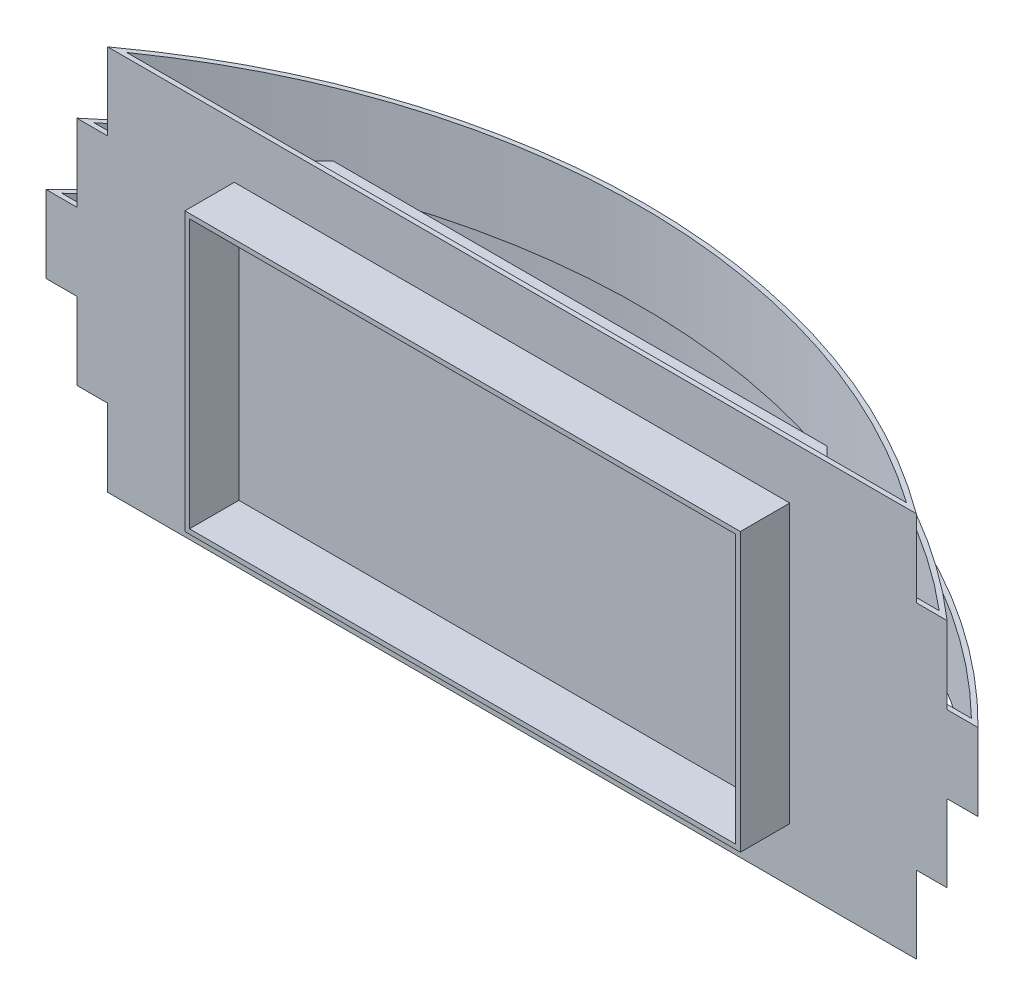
ISO-10303-21;
HEADER;
FILE_DESCRIPTION(('STEP AP214'),'2;1');
FILE_NAME('part.step','',(''),(''),'','','');
FILE_SCHEMA(('AUTOMOTIVE_DESIGN { 1 0 10303 214 1 1 1 1 }'));
ENDSEC;
DATA;
#1=APPLICATION_CONTEXT('core data for automotive mechanical design processes');
#2=APPLICATION_PROTOCOL_DEFINITION('international standard','automotive_design',2000,#1);
#3=PRODUCT_CONTEXT('',#1,'mechanical');
#4=PRODUCT('Part','Part','',(#3));
#5=PRODUCT_RELATED_PRODUCT_CATEGORY('part','',(#4));
#6=PRODUCT_DEFINITION_FORMATION('','',#4);
#7=PRODUCT_DEFINITION_CONTEXT('part definition',#1,'design');
#8=PRODUCT_DEFINITION('design','',#6,#7);
#9=PRODUCT_DEFINITION_SHAPE('','',#8);
#10=(LENGTH_UNIT() NAMED_UNIT(*) SI_UNIT(.MILLI.,.METRE.));
#11=(NAMED_UNIT(*) PLANE_ANGLE_UNIT() SI_UNIT($,.RADIAN.));
#12=(NAMED_UNIT(*) SI_UNIT($,.STERADIAN.) SOLID_ANGLE_UNIT());
#13=UNCERTAINTY_MEASURE_WITH_UNIT(LENGTH_MEASURE(1.E-05),#10,'distance_accuracy_value','');
#14=(GEOMETRIC_REPRESENTATION_CONTEXT(3) GLOBAL_UNCERTAINTY_ASSIGNED_CONTEXT((#13)) GLOBAL_UNIT_ASSIGNED_CONTEXT((#10,
#11,#12)) REPRESENTATION_CONTEXT('',''));
#15=CARTESIAN_POINT('',(0.,0.,0.));
#16=DIRECTION('',(0.,0.,1.));
#17=DIRECTION('',(1.,0.,0.));
#18=AXIS2_PLACEMENT_3D('',#15,#16,#17);
#19=CARTESIAN_POINT('',(-151.,-12.5,0.));
#20=DIRECTION('',(0.,0.,1.));
#21=DIRECTION('',(1.,0.,0.));
#22=AXIS2_PLACEMENT_3D('',#19,#20,#21);
#23=PLANE('',#22);
#24=DIRECTION('',(1.,0.,0.));
#25=VECTOR('',#24,1.);
#26=CARTESIAN_POINT('',(-141.,-37.5,0.));
#27=LINE('',#26,#25);
#28=CARTESIAN_POINT('',(-141.,-37.5,0.));
#29=VERTEX_POINT('',#28);
#30=CARTESIAN_POINT('',(-131.,-37.5,0.));
#31=VERTEX_POINT('',#30);
#32=EDGE_CURVE('E534',#29,#31,#27,.T.);
#33=ORIENTED_EDGE('',*,*,#32,.T.);
#34=DIRECTION('',(0.,1.,0.));
#35=VECTOR('',#34,1.);
#36=CARTESIAN_POINT('',(-131.,-62.5,0.));
#37=LINE('',#36,#35);
#38=CARTESIAN_POINT('',(-131.,-62.5,0.));
#39=VERTEX_POINT('',#38);
#40=EDGE_CURVE('E498',#39,#31,#37,.T.);
#41=ORIENTED_EDGE('',*,*,#40,.F.);
#42=DIRECTION('',(1.,0.,0.));
#43=VECTOR('',#42,1.);
#44=CARTESIAN_POINT('',(-131.,-62.5,0.));
#45=LINE('',#44,#43);
#46=CARTESIAN_POINT('',(131.,-62.5,0.));
#47=VERTEX_POINT('',#46);
#48=EDGE_CURVE('E494',#39,#47,#45,.T.);
#49=ORIENTED_EDGE('',*,*,#48,.T.);
#50=DIRECTION('',(0.,1.,0.));
#51=VECTOR('',#50,1.);
#52=CARTESIAN_POINT('',(131.,-62.5,0.));
#53=LINE('',#52,#51);
#54=CARTESIAN_POINT('',(131.,-37.5,0.));
#55=VERTEX_POINT('',#54);
#56=EDGE_CURVE('E505',#47,#55,#53,.T.);
#57=ORIENTED_EDGE('',*,*,#56,.T.);
#58=CARTESIAN_POINT('',(141.,-37.5,0.));
#59=VERTEX_POINT('',#58);
#60=EDGE_CURVE('E533',#55,#59,#27,.T.);
#61=ORIENTED_EDGE('',*,*,#60,.T.);
#62=DIRECTION('',(0.,1.,0.));
#63=VECTOR('',#62,1.);
#64=CARTESIAN_POINT('',(141.,-37.5,0.));
#65=LINE('',#64,#63);
#66=CARTESIAN_POINT('',(141.,-12.5,0.));
#67=VERTEX_POINT('',#66);
#68=EDGE_CURVE('E545',#59,#67,#65,.T.);
#69=ORIENTED_EDGE('',*,*,#68,.T.);
#70=DIRECTION('',(1.,0.,0.));
#71=VECTOR('',#70,1.);
#72=CARTESIAN_POINT('',(-151.,-12.5,0.));
#73=LINE('',#72,#71);
#74=CARTESIAN_POINT('',(151.,-12.5,0.));
#75=VERTEX_POINT('',#74);
#76=EDGE_CURVE('E680',#67,#75,#73,.T.);
#77=ORIENTED_EDGE('',*,*,#76,.T.);
#78=DIRECTION('',(0.,1.,0.));
#79=VECTOR('',#78,1.);
#80=CARTESIAN_POINT('',(151.,-12.5,0.));
#81=LINE('',#80,#79);
#82=CARTESIAN_POINT('',(151.,12.5,0.));
#83=VERTEX_POINT('',#82);
#84=EDGE_CURVE('E686',#75,#83,#81,.T.);
#85=ORIENTED_EDGE('',*,*,#84,.T.);
#86=DIRECTION('',(1.,0.,0.));
#87=VECTOR('',#86,1.);
#88=CARTESIAN_POINT('',(-151.,12.5,0.));
#89=LINE('',#88,#87);
#90=CARTESIAN_POINT('',(141.,12.5,0.));
#91=VERTEX_POINT('',#90);
#92=EDGE_CURVE('E655',#91,#83,#89,.T.);
#93=ORIENTED_EDGE('',*,*,#92,.F.);
#94=DIRECTION('',(0.,-1.,0.));
#95=VECTOR('',#94,1.);
#96=CARTESIAN_POINT('',(141.,37.5,0.));
#97=LINE('',#96,#95);
#98=CARTESIAN_POINT('',(141.,37.5,0.));
#99=VERTEX_POINT('',#98);
#100=EDGE_CURVE('E626',#99,#91,#97,.T.);
#101=ORIENTED_EDGE('',*,*,#100,.F.);
#102=DIRECTION('',(1.,0.,0.));
#103=VECTOR('',#102,1.);
#104=CARTESIAN_POINT('',(-141.,37.5,0.));
#105=LINE('',#104,#103);
#106=CARTESIAN_POINT('',(131.,37.5,0.));
#107=VERTEX_POINT('',#106);
#108=EDGE_CURVE('E621',#107,#99,#105,.T.);
#109=ORIENTED_EDGE('',*,*,#108,.F.);
#110=DIRECTION('',(0.,-1.,0.));
#111=VECTOR('',#110,1.);
#112=CARTESIAN_POINT('',(131.,62.5,0.));
#113=LINE('',#112,#111);
#114=CARTESIAN_POINT('',(131.,62.5,0.));
#115=VERTEX_POINT('',#114);
#116=EDGE_CURVE('E581',#115,#107,#113,.T.);
#117=ORIENTED_EDGE('',*,*,#116,.F.);
#118=DIRECTION('',(1.,0.,0.));
#119=VECTOR('',#118,1.);
#120=CARTESIAN_POINT('',(-131.,62.5,0.));
#121=LINE('',#120,#119);
#122=CARTESIAN_POINT('',(-131.,62.5,0.));
#123=VERTEX_POINT('',#122);
#124=EDGE_CURVE('E578',#123,#115,#121,.T.);
#125=ORIENTED_EDGE('',*,*,#124,.F.);
#126=DIRECTION('',(0.,-1.,0.));
#127=VECTOR('',#126,1.);
#128=CARTESIAN_POINT('',(-131.,62.5,0.));
#129=LINE('',#128,#127);
#130=CARTESIAN_POINT('',(-131.,37.5,0.));
#131=VERTEX_POINT('',#130);
#132=EDGE_CURVE('E587',#123,#131,#129,.T.);
#133=ORIENTED_EDGE('',*,*,#132,.T.);
#134=CARTESIAN_POINT('',(-141.,37.5,0.));
#135=VERTEX_POINT('',#134);
#136=EDGE_CURVE('E622',#135,#131,#105,.T.);
#137=ORIENTED_EDGE('',*,*,#136,.F.);
#138=DIRECTION('',(0.,-1.,0.));
#139=VECTOR('',#138,1.);
#140=CARTESIAN_POINT('',(-141.,37.5,0.));
#141=LINE('',#140,#139);
#142=CARTESIAN_POINT('',(-141.,12.5,0.));
#143=VERTEX_POINT('',#142);
#144=EDGE_CURVE('E632',#135,#143,#141,.T.);
#145=ORIENTED_EDGE('',*,*,#144,.T.);
#146=CARTESIAN_POINT('',(-151.,12.5,0.));
#147=VERTEX_POINT('',#146);
#148=EDGE_CURVE('E656',#147,#143,#89,.T.);
#149=ORIENTED_EDGE('',*,*,#148,.F.);
#150=DIRECTION('',(0.,1.,0.));
#151=VECTOR('',#150,1.);
#152=CARTESIAN_POINT('',(-151.,-12.5,0.));
#153=LINE('',#152,#151);
#154=CARTESIAN_POINT('',(-151.,-12.5,0.));
#155=VERTEX_POINT('',#154);
#156=EDGE_CURVE('E685',#155,#147,#153,.T.);
#157=ORIENTED_EDGE('',*,*,#156,.F.);
#158=CARTESIAN_POINT('',(-141.,-12.5,0.));
#159=VERTEX_POINT('',#158);
#160=EDGE_CURVE('E681',#155,#159,#73,.T.);
#161=ORIENTED_EDGE('',*,*,#160,.T.);
#162=DIRECTION('',(0.,1.,0.));
#163=VECTOR('',#162,1.);
#164=CARTESIAN_POINT('',(-141.,-37.5,0.));
#165=LINE('',#164,#163);
#166=EDGE_CURVE('E538',#29,#159,#165,.T.);
#167=ORIENTED_EDGE('',*,*,#166,.F.);
#168=EDGE_LOOP('',(#33,#41,#49,#57,#61,#69,#77,#85,#93,#101,#109,#117,#125,#133,#137,#145,#149,
#157,#161,#167));
#169=FACE_BOUND('',#168,.T.);
#170=DIRECTION('',(-1.,0.,0.));
#171=VECTOR('',#170,1.);
#172=CARTESIAN_POINT('',(-90.,45.,0.));
#173=LINE('',#172,#171);
#174=CARTESIAN_POINT('',(90.,45.,0.));
#175=VERTEX_POINT('',#174);
#176=CARTESIAN_POINT('',(-90.,45.,0.));
#177=VERTEX_POINT('',#176);
#178=EDGE_CURVE('E449',#175,#177,#173,.T.);
#179=ORIENTED_EDGE('',*,*,#178,.F.);
#180=DIRECTION('',(0.,1.,0.));
#181=VECTOR('',#180,1.);
#182=CARTESIAN_POINT('',(90.,45.,0.));
#183=LINE('',#182,#181);
#184=CARTESIAN_POINT('',(90.,-45.,0.));
#185=VERTEX_POINT('',#184);
#186=EDGE_CURVE('E430',#185,#175,#183,.T.);
#187=ORIENTED_EDGE('',*,*,#186,.F.);
#188=DIRECTION('',(1.,0.,0.));
#189=VECTOR('',#188,1.);
#190=CARTESIAN_POINT('',(-90.,-45.,0.));
#191=LINE('',#190,#189);
#192=CARTESIAN_POINT('',(-90.,-45.,0.));
#193=VERTEX_POINT('',#192);
#194=EDGE_CURVE('E436',#193,#185,#191,.T.);
#195=ORIENTED_EDGE('',*,*,#194,.F.);
#196=DIRECTION('',(0.,-1.,0.));
#197=VECTOR('',#196,1.);
#198=CARTESIAN_POINT('',(-90.,45.,0.));
#199=LINE('',#198,#197);
#200=EDGE_CURVE('E452',#177,#193,#199,.T.);
#201=ORIENTED_EDGE('',*,*,#200,.F.);
#202=EDGE_LOOP('',(#179,#187,#195,#201));
#203=FACE_BOUND('',#202,.T.);
#204=ADVANCED_FACE('F41',(#169,#203),#23,.T.);
#205=CARTESIAN_POINT('',(0.,37.5,161.036771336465));
#206=DIRECTION('',(0.,1.,0.));
#207=DIRECTION('',(0.,0.,1.));
#208=AXIS2_PLACEMENT_3D('',#205,#206,#207);
#209=PLANE('',#208);
#210=ORIENTED_EDGE('',*,*,#136,.T.);
#211=CARTESIAN_POINT('',(0.,37.5,177.838386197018));
#212=DIRECTION('',(0.,1.,0.));
#213=DIRECTION('',(0.,0.,1.));
#214=AXIS2_PLACEMENT_3D('',#211,#212,#213);
#215=CIRCLE('',#214,220.878907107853);
#216=CARTESIAN_POINT('',(-128.938880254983,37.5,-1.5));
#217=VERTEX_POINT('',#216);
#218=EDGE_CURVE('E704',#131,#217,#215,.F.);
#219=ORIENTED_EDGE('',*,*,#218,.T.);
#220=DIRECTION('',(1.,0.,0.));
#221=VECTOR('',#220,1.);
#222=CARTESIAN_POINT('',(-136.951687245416,37.5,-1.5));
#223=LINE('',#222,#221);
#224=CARTESIAN_POINT('',(-136.951687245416,37.5,-1.5));
#225=VERTEX_POINT('',#224);
#226=EDGE_CURVE('E603',#225,#217,#223,.T.);
#227=ORIENTED_EDGE('',*,*,#226,.F.);
#228=CARTESIAN_POINT('',(0.,37.5,161.036771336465));
#229=DIRECTION('',(0.,1.,0.));
#230=DIRECTION('',(0.,0.,1.));
#231=AXIS2_PLACEMENT_3D('',#228,#229,#230);
#232=CIRCLE('',#231,212.541682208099);
#233=CARTESIAN_POINT('',(136.951687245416,37.5,-1.5));
#234=VERTEX_POINT('',#233);
#235=EDGE_CURVE('E598',#234,#225,#232,.T.);
#236=ORIENTED_EDGE('',*,*,#235,.F.);
#237=CARTESIAN_POINT('',(128.938880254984,37.5,-1.5));
#238=VERTEX_POINT('',#237);
#239=EDGE_CURVE('E602',#238,#234,#223,.T.);
#240=ORIENTED_EDGE('',*,*,#239,.F.);
#241=EDGE_CURVE('E699',#238,#107,#215,.F.);
#242=ORIENTED_EDGE('',*,*,#241,.T.);
#243=ORIENTED_EDGE('',*,*,#108,.T.);
#244=CARTESIAN_POINT('',(0.,37.5,161.036771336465));
#245=DIRECTION('',(0.,1.,0.));
#246=DIRECTION('',(0.,0.,1.));
#247=AXIS2_PLACEMENT_3D('',#244,#245,#246);
#248=CIRCLE('',#247,214.041682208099);
#249=EDGE_CURVE('E617',#99,#135,#248,.T.);
#250=ORIENTED_EDGE('',*,*,#249,.T.);
#251=EDGE_LOOP('',(#210,#219,#227,#236,#240,#242,#243,#250));
#252=FACE_BOUND('',#251,.T.);
#253=ADVANCED_FACE('F800',(#252),#209,.T.);
#254=CARTESIAN_POINT('',(0.,12.5,149.093625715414));
#255=DIRECTION('',(0.,-1.,0.));
#256=DIRECTION('',(0.,0.,-1.));
#257=AXIS2_PLACEMENT_3D('',#254,#255,#256);
#258=PLANE('',#257);
#259=CARTESIAN_POINT('',(0.,12.5,161.036771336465));
#260=DIRECTION('',(0.,-1.,0.));
#261=DIRECTION('',(0.,0.,-1.));
#262=AXIS2_PLACEMENT_3D('',#259,#260,#261);
#263=CIRCLE('',#262,214.041682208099);
#264=CARTESIAN_POINT('',(-139.268229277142,12.5,-1.5));
#265=VERTEX_POINT('',#264);
#266=EDGE_CURVE('E695',#265,#143,#263,.F.);
#267=ORIENTED_EDGE('',*,*,#266,.F.);
#268=DIRECTION('',(1.,0.,0.));
#269=VECTOR('',#268,1.);
#270=CARTESIAN_POINT('',(-147.36726761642,12.5,-1.5));
#271=LINE('',#270,#269);
#272=CARTESIAN_POINT('',(-147.36726761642,12.5,-1.5));
#273=VERTEX_POINT('',#272);
#274=EDGE_CURVE('E647',#273,#265,#271,.T.);
#275=ORIENTED_EDGE('',*,*,#274,.F.);
#276=CARTESIAN_POINT('',(0.,12.5,149.093625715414));
#277=DIRECTION('',(0.,1.,0.));
#278=DIRECTION('',(0.,0.,-1.));
#279=AXIS2_PLACEMENT_3D('',#276,#277,#278);
#280=CIRCLE('',#279,210.702519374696);
#281=CARTESIAN_POINT('',(147.36726761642,12.5,-1.5));
#282=VERTEX_POINT('',#281);
#283=EDGE_CURVE('E642',#282,#273,#280,.T.);
#284=ORIENTED_EDGE('',*,*,#283,.F.);
#285=CARTESIAN_POINT('',(139.268229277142,12.5,-1.5));
#286=VERTEX_POINT('',#285);
#287=EDGE_CURVE('E646',#286,#282,#271,.T.);
#288=ORIENTED_EDGE('',*,*,#287,.F.);
#289=EDGE_CURVE('E690',#91,#286,#263,.F.);
#290=ORIENTED_EDGE('',*,*,#289,.F.);
#291=ORIENTED_EDGE('',*,*,#92,.T.);
#292=CARTESIAN_POINT('',(0.,12.5,149.093625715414));
#293=DIRECTION('',(0.,1.,0.));
#294=DIRECTION('',(0.,0.,-1.));
#295=AXIS2_PLACEMENT_3D('',#292,#293,#294);
#296=CIRCLE('',#295,212.202519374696);
#297=EDGE_CURVE('E651',#83,#147,#296,.T.);
#298=ORIENTED_EDGE('',*,*,#297,.T.);
#299=ORIENTED_EDGE('',*,*,#148,.T.);
#300=EDGE_LOOP('',(#267,#275,#284,#288,#290,#291,#298,#299));
#301=FACE_BOUND('',#300,.T.);
#302=ADVANCED_FACE('F808',(#301),#258,.F.);
#303=CARTESIAN_POINT('',(0.,-12.5,149.093625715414));
#304=DIRECTION('',(0.,1.,0.));
#305=DIRECTION('',(0.,0.,1.));
#306=AXIS2_PLACEMENT_3D('',#303,#304,#305);
#307=CYLINDRICAL_SURFACE('',#306,212.202519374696);
#308=ORIENTED_EDGE('',*,*,#156,.T.);
#309=ORIENTED_EDGE('',*,*,#297,.F.);
#310=ORIENTED_EDGE('',*,*,#84,.F.);
#311=CARTESIAN_POINT('',(0.,-12.5,149.093625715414));
#312=DIRECTION('',(0.,1.,0.));
#313=DIRECTION('',(0.,0.,-1.));
#314=AXIS2_PLACEMENT_3D('',#311,#312,#313);
#315=CIRCLE('',#314,212.202519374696);
#316=EDGE_CURVE('E674',#75,#155,#315,.T.);
#317=ORIENTED_EDGE('',*,*,#316,.T.);
#318=EDGE_LOOP('',(#308,#309,#310,#317));
#319=FACE_BOUND('',#318,.T.);
#320=ADVANCED_FACE('F969',(#319),#307,.T.);
#321=CARTESIAN_POINT('',(0.,-12.5,149.093625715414));
#322=DIRECTION('',(0.,-1.,0.));
#323=DIRECTION('',(0.,0.,-1.));
#324=AXIS2_PLACEMENT_3D('',#321,#322,#323);
#325=PLANE('',#324);
#326=CARTESIAN_POINT('',(0.,-12.5,161.036771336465));
#327=DIRECTION('',(0.,-1.,0.));
#328=DIRECTION('',(0.,0.,-1.));
#329=AXIS2_PLACEMENT_3D('',#326,#327,#328);
#330=CIRCLE('',#329,214.041682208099);
#331=CARTESIAN_POINT('',(139.268229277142,-12.5,-1.5));
#332=VERTEX_POINT('',#331);
#333=EDGE_CURVE('E553',#332,#67,#330,.T.);
#334=ORIENTED_EDGE('',*,*,#333,.F.);
#335=DIRECTION('',(1.,0.,0.));
#336=VECTOR('',#335,1.);
#337=CARTESIAN_POINT('',(-147.36726761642,-12.5,-1.5));
#338=LINE('',#337,#336);
#339=CARTESIAN_POINT('',(147.36726761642,-12.5,-1.5));
#340=VERTEX_POINT('',#339);
#341=EDGE_CURVE('E664',#332,#340,#338,.T.);
#342=ORIENTED_EDGE('',*,*,#341,.T.);
#343=CARTESIAN_POINT('',(0.,-12.5,149.093625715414));
#344=DIRECTION('',(0.,1.,0.));
#345=DIRECTION('',(0.,0.,-1.));
#346=AXIS2_PLACEMENT_3D('',#343,#344,#345);
#347=CIRCLE('',#346,210.702519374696);
#348=CARTESIAN_POINT('',(-147.36726761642,-12.5,-1.5));
#349=VERTEX_POINT('',#348);
#350=EDGE_CURVE('E660',#340,#349,#347,.T.);
#351=ORIENTED_EDGE('',*,*,#350,.T.);
#352=CARTESIAN_POINT('',(-139.268229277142,-12.5,-1.5));
#353=VERTEX_POINT('',#352);
#354=EDGE_CURVE('E665',#349,#353,#338,.T.);
#355=ORIENTED_EDGE('',*,*,#354,.T.);
#356=EDGE_CURVE('E549',#159,#353,#330,.T.);
#357=ORIENTED_EDGE('',*,*,#356,.F.);
#358=ORIENTED_EDGE('',*,*,#160,.F.);
#359=ORIENTED_EDGE('',*,*,#316,.F.);
#360=ORIENTED_EDGE('',*,*,#76,.F.);
#361=EDGE_LOOP('',(#334,#342,#351,#355,#357,#358,#359,#360));
#362=FACE_BOUND('',#361,.T.);
#363=ADVANCED_FACE('F971',(#362),#325,.T.);
#364=CARTESIAN_POINT('',(0.,-12.5,149.093625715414));
#365=DIRECTION('',(0.,1.,0.));
#366=DIRECTION('',(0.,0.,1.));
#367=AXIS2_PLACEMENT_3D('',#364,#365,#366);
#368=CYLINDRICAL_SURFACE('',#367,210.702519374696);
#369=DIRECTION('',(0.,1.,0.));
#370=VECTOR('',#369,1.);
#371=CARTESIAN_POINT('',(147.36726761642,-12.5,-1.5));
#372=LINE('',#371,#370);
#373=EDGE_CURVE('E670',#340,#282,#372,.T.);
#374=ORIENTED_EDGE('',*,*,#373,.T.);
#375=ORIENTED_EDGE('',*,*,#283,.T.);
#376=DIRECTION('',(0.,1.,0.));
#377=VECTOR('',#376,1.);
#378=CARTESIAN_POINT('',(-147.36726761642,-12.5,-1.5));
#379=LINE('',#378,#377);
#380=EDGE_CURVE('E669',#349,#273,#379,.T.);
#381=ORIENTED_EDGE('',*,*,#380,.F.);
#382=ORIENTED_EDGE('',*,*,#350,.F.);
#383=EDGE_LOOP('',(#374,#375,#381,#382));
#384=FACE_BOUND('',#383,.T.);
#385=ADVANCED_FACE('F977',(#384),#368,.F.);
#386=CARTESIAN_POINT('',(-147.36726761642,-12.5,-1.5));
#387=DIRECTION('',(0.,0.,1.));
#388=DIRECTION('',(1.,0.,0.));
#389=AXIS2_PLACEMENT_3D('',#386,#387,#388);
#390=PLANE('',#389);
#391=DIRECTION('',(-1.,0.,0.));
#392=VECTOR('',#391,1.);
#393=CARTESIAN_POINT('',(-147.36726761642,45.,-1.5));
#394=LINE('',#393,#392);
#395=CARTESIAN_POINT('',(90.,45.,-1.5));
#396=VERTEX_POINT('',#395);
#397=CARTESIAN_POINT('',(-90.,45.,-1.5));
#398=VERTEX_POINT('',#397);
#399=EDGE_CURVE('E339',#396,#398,#394,.T.);
#400=ORIENTED_EDGE('',*,*,#399,.T.);
#401=DIRECTION('',(0.,-1.,0.));
#402=VECTOR('',#401,1.);
#403=CARTESIAN_POINT('',(-90.,-12.5,-1.5));
#404=LINE('',#403,#402);
#405=CARTESIAN_POINT('',(-90.,-45.,-1.5));
#406=VERTEX_POINT('',#405);
#407=EDGE_CURVE('E318',#398,#406,#404,.T.);
#408=ORIENTED_EDGE('',*,*,#407,.T.);
#409=DIRECTION('',(1.,0.,0.));
#410=VECTOR('',#409,1.);
#411=CARTESIAN_POINT('',(-147.36726761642,-45.,-1.5));
#412=LINE('',#411,#410);
#413=CARTESIAN_POINT('',(90.,-45.,-1.5));
#414=VERTEX_POINT('',#413);
#415=EDGE_CURVE('E326',#406,#414,#412,.T.);
#416=ORIENTED_EDGE('',*,*,#415,.T.);
#417=DIRECTION('',(0.,1.,0.));
#418=VECTOR('',#417,1.);
#419=CARTESIAN_POINT('',(90.,-12.5,-1.5));
#420=LINE('',#419,#418);
#421=EDGE_CURVE('E333',#414,#396,#420,.T.);
#422=ORIENTED_EDGE('',*,*,#421,.T.);
#423=EDGE_LOOP('',(#400,#408,#416,#422));
#424=FACE_BOUND('',#423,.T.);
#425=DIRECTION('',(1.,0.,0.));
#426=VECTOR('',#425,1.);
#427=CARTESIAN_POINT('',(-147.36726761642,-34.5,-1.5));
#428=LINE('',#427,#426);
#429=CARTESIAN_POINT('',(-128.938880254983,-34.5,-1.5));
#430=VERTEX_POINT('',#429);
#431=CARTESIAN_POINT('',(-126.352079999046,-34.5,-1.5));
#432=VERTEX_POINT('',#431);
#433=EDGE_CURVE('E334',#430,#432,#428,.T.);
#434=ORIENTED_EDGE('',*,*,#433,.F.);
#435=DIRECTION('',(0.,1.,0.));
#436=VECTOR('',#435,1.);
#437=CARTESIAN_POINT('',(-128.938880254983,-62.5,-1.5));
#438=LINE('',#437,#436);
#439=CARTESIAN_POINT('',(-128.938880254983,-37.5,-1.5));
#440=VERTEX_POINT('',#439);
#441=EDGE_CURVE('E509',#430,#440,#438,.F.);
#442=ORIENTED_EDGE('',*,*,#441,.T.);
#443=DIRECTION('',(1.,0.,0.));
#444=VECTOR('',#443,1.);
#445=CARTESIAN_POINT('',(-136.951687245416,-37.5,-1.5));
#446=LINE('',#445,#444);
#447=CARTESIAN_POINT('',(-136.951687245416,-37.5,-1.5));
#448=VERTEX_POINT('',#447);
#449=EDGE_CURVE('E521',#448,#440,#446,.T.);
#450=ORIENTED_EDGE('',*,*,#449,.F.);
#451=DIRECTION('',(0.,1.,0.));
#452=VECTOR('',#451,1.);
#453=CARTESIAN_POINT('',(-136.951687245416,-37.5,-1.5));
#454=LINE('',#453,#452);
#455=CARTESIAN_POINT('',(-136.951687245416,-9.5,-1.5));
#456=VERTEX_POINT('',#455);
#457=EDGE_CURVE('E708',#456,#448,#454,.F.);
#458=ORIENTED_EDGE('',*,*,#457,.F.);
#459=DIRECTION('',(1.,0.,0.));
#460=VECTOR('',#459,1.);
#461=CARTESIAN_POINT('',(-147.36726761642,-9.5,-1.5));
#462=LINE('',#461,#460);
#463=CARTESIAN_POINT('',(-139.268229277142,-9.5,-1.5));
#464=VERTEX_POINT('',#463);
#465=EDGE_CURVE('E713',#464,#456,#462,.T.);
#466=ORIENTED_EDGE('',*,*,#465,.F.);
#467=DIRECTION('',(0.,1.,0.));
#468=VECTOR('',#467,1.);
#469=CARTESIAN_POINT('',(-139.268229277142,-37.5,-1.5));
#470=LINE('',#469,#468);
#471=EDGE_CURVE('E717',#464,#353,#470,.F.);
#472=ORIENTED_EDGE('',*,*,#471,.T.);
#473=ORIENTED_EDGE('',*,*,#354,.F.);
#474=ORIENTED_EDGE('',*,*,#380,.T.);
#475=ORIENTED_EDGE('',*,*,#274,.T.);
#476=DIRECTION('',(0.,-1.,0.));
#477=VECTOR('',#476,1.);
#478=CARTESIAN_POINT('',(-139.268229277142,37.5,-1.5));
#479=LINE('',#478,#477);
#480=CARTESIAN_POINT('',(-139.268229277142,9.5,-1.49999999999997));
#481=VERTEX_POINT('',#480);
#482=EDGE_CURVE('E639',#481,#265,#479,.F.);
#483=ORIENTED_EDGE('',*,*,#482,.F.);
#484=DIRECTION('',(-1.,0.,0.));
#485=VECTOR('',#484,1.);
#486=CARTESIAN_POINT('',(-147.36726761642,9.5,-1.5));
#487=LINE('',#486,#485);
#488=CARTESIAN_POINT('',(-136.951687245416,9.5,-1.5));
#489=VERTEX_POINT('',#488);
#490=EDGE_CURVE('E696',#489,#481,#487,.T.);
#491=ORIENTED_EDGE('',*,*,#490,.F.);
#492=DIRECTION('',(0.,-1.,0.));
#493=VECTOR('',#492,1.);
#494=CARTESIAN_POINT('',(-136.951687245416,37.5,-1.5));
#495=LINE('',#494,#493);
#496=EDGE_CURVE('E613',#225,#489,#495,.T.);
#497=ORIENTED_EDGE('',*,*,#496,.F.);
#498=ORIENTED_EDGE('',*,*,#226,.T.);
#499=DIRECTION('',(0.,-1.,0.));
#500=VECTOR('',#499,1.);
#501=CARTESIAN_POINT('',(-128.938880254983,62.5,-1.5));
#502=LINE('',#501,#500);
#503=CARTESIAN_POINT('',(-128.938880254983,34.5,-1.5));
#504=VERTEX_POINT('',#503);
#505=EDGE_CURVE('E594',#504,#217,#502,.F.);
#506=ORIENTED_EDGE('',*,*,#505,.F.);
#507=DIRECTION('',(-1.,0.,0.));
#508=VECTOR('',#507,1.);
#509=CARTESIAN_POINT('',(-147.36726761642,34.5,-1.5));
#510=LINE('',#509,#508);
#511=CARTESIAN_POINT('',(-126.352079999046,34.5,-1.5));
#512=VERTEX_POINT('',#511);
#513=EDGE_CURVE('E705',#512,#504,#510,.T.);
#514=ORIENTED_EDGE('',*,*,#513,.F.);
#515=DIRECTION('',(0.,-1.,0.));
#516=VECTOR('',#515,1.);
#517=CARTESIAN_POINT('',(-126.352079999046,62.5,-1.5));
#518=LINE('',#517,#516);
#519=CARTESIAN_POINT('',(-126.352079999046,62.5,-1.5));
#520=VERTEX_POINT('',#519);
#521=EDGE_CURVE('E570',#520,#512,#518,.T.);
#522=ORIENTED_EDGE('',*,*,#521,.F.);
#523=DIRECTION('',(1.,0.,0.));
#524=VECTOR('',#523,1.);
#525=CARTESIAN_POINT('',(-126.352079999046,62.5,-1.5));
#526=LINE('',#525,#524);
#527=CARTESIAN_POINT('',(126.352079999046,62.5,-1.5));
#528=VERTEX_POINT('',#527);
#529=EDGE_CURVE('E558',#520,#528,#526,.T.);
#530=ORIENTED_EDGE('',*,*,#529,.T.);
#531=DIRECTION('',(0.,-1.,0.));
#532=VECTOR('',#531,1.);
#533=CARTESIAN_POINT('',(126.352079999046,62.5,-1.5));
#534=LINE('',#533,#532);
#535=CARTESIAN_POINT('',(126.352079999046,34.5,-1.5));
#536=VERTEX_POINT('',#535);
#537=EDGE_CURVE('E563',#528,#536,#534,.T.);
#538=ORIENTED_EDGE('',*,*,#537,.T.);
#539=CARTESIAN_POINT('',(128.938880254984,34.5,-1.5));
#540=VERTEX_POINT('',#539);
#541=EDGE_CURVE('E709',#540,#536,#510,.T.);
#542=ORIENTED_EDGE('',*,*,#541,.F.);
#543=DIRECTION('',(0.,-1.,0.));
#544=VECTOR('',#543,1.);
#545=CARTESIAN_POINT('',(128.938880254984,62.5,-1.5));
#546=LINE('',#545,#544);
#547=EDGE_CURVE('E591',#238,#540,#546,.T.);
#548=ORIENTED_EDGE('',*,*,#547,.F.);
#549=ORIENTED_EDGE('',*,*,#239,.T.);
#550=DIRECTION('',(0.,-1.,0.));
#551=VECTOR('',#550,1.);
#552=CARTESIAN_POINT('',(136.951687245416,37.5,-1.5));
#553=LINE('',#552,#551);
#554=CARTESIAN_POINT('',(136.951687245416,9.5,-1.5));
#555=VERTEX_POINT('',#554);
#556=EDGE_CURVE('E607',#234,#555,#553,.T.);
#557=ORIENTED_EDGE('',*,*,#556,.T.);
#558=CARTESIAN_POINT('',(139.268229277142,9.5,-1.49999999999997));
#559=VERTEX_POINT('',#558);
#560=EDGE_CURVE('E700',#559,#555,#487,.T.);
#561=ORIENTED_EDGE('',*,*,#560,.F.);
#562=DIRECTION('',(0.,-1.,0.));
#563=VECTOR('',#562,1.);
#564=CARTESIAN_POINT('',(139.268229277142,37.5,-1.5));
#565=LINE('',#564,#563);
#566=EDGE_CURVE('E636',#286,#559,#565,.T.);
#567=ORIENTED_EDGE('',*,*,#566,.F.);
#568=ORIENTED_EDGE('',*,*,#287,.T.);
#569=ORIENTED_EDGE('',*,*,#373,.F.);
#570=ORIENTED_EDGE('',*,*,#341,.F.);
#571=DIRECTION('',(0.,1.,0.));
#572=VECTOR('',#571,1.);
#573=CARTESIAN_POINT('',(139.268229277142,-37.5,-1.5));
#574=LINE('',#573,#572);
#575=CARTESIAN_POINT('',(139.268229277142,-9.5,-1.5));
#576=VERTEX_POINT('',#575);
#577=EDGE_CURVE('E718',#332,#576,#574,.T.);
#578=ORIENTED_EDGE('',*,*,#577,.T.);
#579=CARTESIAN_POINT('',(136.951687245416,-9.5,-1.5));
#580=VERTEX_POINT('',#579);
#581=EDGE_CURVE('E719',#580,#576,#462,.T.);
#582=ORIENTED_EDGE('',*,*,#581,.F.);
#583=DIRECTION('',(0.,1.,0.));
#584=VECTOR('',#583,1.);
#585=CARTESIAN_POINT('',(136.951687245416,-37.5,-1.5));
#586=LINE('',#585,#584);
#587=CARTESIAN_POINT('',(136.951687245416,-37.5,-1.5));
#588=VERTEX_POINT('',#587);
#589=EDGE_CURVE('E712',#588,#580,#586,.T.);
#590=ORIENTED_EDGE('',*,*,#589,.F.);
#591=CARTESIAN_POINT('',(128.938880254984,-37.5,-1.5));
#592=VERTEX_POINT('',#591);
#593=EDGE_CURVE('E520',#592,#588,#446,.T.);
#594=ORIENTED_EDGE('',*,*,#593,.F.);
#595=DIRECTION('',(0.,1.,0.));
#596=VECTOR('',#595,1.);
#597=CARTESIAN_POINT('',(128.938880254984,-62.5,-1.5));
#598=LINE('',#597,#596);
#599=CARTESIAN_POINT('',(128.938880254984,-34.5,-1.5));
#600=VERTEX_POINT('',#599);
#601=EDGE_CURVE('E512',#592,#600,#598,.T.);
#602=ORIENTED_EDGE('',*,*,#601,.T.);
#603=CARTESIAN_POINT('',(126.352079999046,-34.5,-1.5));
#604=VERTEX_POINT('',#603);
#605=EDGE_CURVE('E734',#604,#600,#428,.T.);
#606=ORIENTED_EDGE('',*,*,#605,.F.);
#607=DIRECTION('',(0.,1.,0.));
#608=VECTOR('',#607,1.);
#609=CARTESIAN_POINT('',(126.352079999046,-62.5,-1.5));
#610=LINE('',#609,#608);
#611=CARTESIAN_POINT('',(126.352079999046,-62.5,-1.5));
#612=VERTEX_POINT('',#611);
#613=EDGE_CURVE('E486',#612,#604,#610,.T.);
#614=ORIENTED_EDGE('',*,*,#613,.F.);
#615=DIRECTION('',(1.,0.,0.));
#616=VECTOR('',#615,1.);
#617=CARTESIAN_POINT('',(-126.352079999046,-62.5,-1.5));
#618=LINE('',#617,#616);
#619=CARTESIAN_POINT('',(-126.352079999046,-62.5,-1.5));
#620=VERTEX_POINT('',#619);
#621=EDGE_CURVE('E476',#620,#612,#618,.T.);
#622=ORIENTED_EDGE('',*,*,#621,.F.);
#623=DIRECTION('',(0.,1.,0.));
#624=VECTOR('',#623,1.);
#625=CARTESIAN_POINT('',(-126.352079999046,-62.5,-1.5));
#626=LINE('',#625,#624);
#627=EDGE_CURVE('E480',#620,#432,#626,.T.);
#628=ORIENTED_EDGE('',*,*,#627,.T.);
#629=EDGE_LOOP('',(#434,#442,#450,#458,#466,#472,#473,#474,#475,#483,#491,#497,#498,#506,#514,
#522,#530,#538,#542,#548,#549,#557,#561,#567,#568,#569,#570,#578,#582,#590,#594,#602,#606,#614,
#622,#628));
#630=FACE_BOUND('',#629,.T.);
#631=ADVANCED_FACE('F336',(#424,#630),#390,.F.);
#632=CARTESIAN_POINT('',(0.,9.5,161.036771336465));
#633=DIRECTION('',(0.,1.,0.));
#634=DIRECTION('',(0.,0.,1.));
#635=AXIS2_PLACEMENT_3D('',#632,#633,#634);
#636=PLANE('',#635);
#637=CARTESIAN_POINT('',(0.,9.5,161.036771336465));
#638=DIRECTION('',(0.,1.,0.));
#639=DIRECTION('',(0.,0.,1.));
#640=AXIS2_PLACEMENT_3D('',#637,#638,#639);
#641=CIRCLE('',#640,214.041682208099);
#642=EDGE_CURVE('E616',#559,#481,#641,.T.);
#643=ORIENTED_EDGE('',*,*,#642,.F.);
#644=ORIENTED_EDGE('',*,*,#560,.T.);
#645=CARTESIAN_POINT('',(0.,9.5,161.036771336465));
#646=DIRECTION('',(0.,1.,0.));
#647=DIRECTION('',(0.,0.,1.));
#648=AXIS2_PLACEMENT_3D('',#645,#646,#647);
#649=CIRCLE('',#648,212.541682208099);
#650=EDGE_CURVE('E597',#555,#489,#649,.T.);
#651=ORIENTED_EDGE('',*,*,#650,.T.);
#652=ORIENTED_EDGE('',*,*,#490,.T.);
#653=EDGE_LOOP('',(#643,#644,#651,#652));
#654=FACE_BOUND('',#653,.T.);
#655=ADVANCED_FACE('F1027',(#654),#636,.F.);
#656=CARTESIAN_POINT('',(0.,37.5,161.036771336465));
#657=DIRECTION('',(0.,-1.,0.));
#658=DIRECTION('',(0.,0.,-1.));
#659=AXIS2_PLACEMENT_3D('',#656,#657,#658);
#660=CYLINDRICAL_SURFACE('',#659,214.041682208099);
#661=ORIENTED_EDGE('',*,*,#642,.T.);
#662=ORIENTED_EDGE('',*,*,#482,.T.);
#663=ORIENTED_EDGE('',*,*,#266,.T.);
#664=ORIENTED_EDGE('',*,*,#144,.F.);
#665=ORIENTED_EDGE('',*,*,#249,.F.);
#666=ORIENTED_EDGE('',*,*,#100,.T.);
#667=ORIENTED_EDGE('',*,*,#289,.T.);
#668=ORIENTED_EDGE('',*,*,#566,.T.);
#669=EDGE_LOOP('',(#661,#662,#663,#664,#665,#666,#667,#668));
#670=FACE_BOUND('',#669,.T.);
#671=ADVANCED_FACE('F1024',(#670),#660,.T.);
#672=CARTESIAN_POINT('',(0.,37.5,161.036771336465));
#673=DIRECTION('',(0.,-1.,0.));
#674=DIRECTION('',(0.,0.,-1.));
#675=AXIS2_PLACEMENT_3D('',#672,#673,#674);
#676=CYLINDRICAL_SURFACE('',#675,212.541682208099);
#677=ORIENTED_EDGE('',*,*,#650,.F.);
#678=ORIENTED_EDGE('',*,*,#556,.F.);
#679=ORIENTED_EDGE('',*,*,#235,.T.);
#680=ORIENTED_EDGE('',*,*,#496,.T.);
#681=EDGE_LOOP('',(#677,#678,#679,#680));
#682=FACE_BOUND('',#681,.T.);
#683=ADVANCED_FACE('F1018',(#682),#676,.F.);
#684=CARTESIAN_POINT('',(0.,34.5,177.838386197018));
#685=DIRECTION('',(0.,1.,0.));
#686=DIRECTION('',(0.,0.,1.));
#687=AXIS2_PLACEMENT_3D('',#684,#685,#686);
#688=PLANE('',#687);
#689=CARTESIAN_POINT('',(0.,34.5,177.838386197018));
#690=DIRECTION('',(0.,1.,0.));
#691=DIRECTION('',(0.,0.,1.));
#692=AXIS2_PLACEMENT_3D('',#689,#690,#691);
#693=CIRCLE('',#692,220.878907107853);
#694=EDGE_CURVE('E573',#540,#504,#693,.T.);
#695=ORIENTED_EDGE('',*,*,#694,.F.);
#696=ORIENTED_EDGE('',*,*,#541,.T.);
#697=CARTESIAN_POINT('',(0.,34.5,177.838386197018));
#698=DIRECTION('',(0.,1.,0.));
#699=DIRECTION('',(0.,0.,1.));
#700=AXIS2_PLACEMENT_3D('',#697,#698,#699);
#701=CIRCLE('',#700,219.378907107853);
#702=EDGE_CURVE('E559',#536,#512,#701,.T.);
#703=ORIENTED_EDGE('',*,*,#702,.T.);
#704=ORIENTED_EDGE('',*,*,#513,.T.);
#705=EDGE_LOOP('',(#695,#696,#703,#704));
#706=FACE_BOUND('',#705,.T.);
#707=ADVANCED_FACE('F1015',(#706),#688,.F.);
#708=CARTESIAN_POINT('',(0.,62.5,177.838386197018));
#709=DIRECTION('',(0.,-1.,0.));
#710=DIRECTION('',(0.,0.,-1.));
#711=AXIS2_PLACEMENT_3D('',#708,#709,#710);
#712=CYLINDRICAL_SURFACE('',#711,220.878907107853);
#713=ORIENTED_EDGE('',*,*,#694,.T.);
#714=ORIENTED_EDGE('',*,*,#505,.T.);
#715=ORIENTED_EDGE('',*,*,#218,.F.);
#716=ORIENTED_EDGE('',*,*,#132,.F.);
#717=CARTESIAN_POINT('',(0.,62.5,177.838386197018));
#718=DIRECTION('',(0.,1.,0.));
#719=DIRECTION('',(0.,0.,1.));
#720=AXIS2_PLACEMENT_3D('',#717,#718,#719);
#721=CIRCLE('',#720,220.878907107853);
#722=EDGE_CURVE('E574',#115,#123,#721,.T.);
#723=ORIENTED_EDGE('',*,*,#722,.F.);
#724=ORIENTED_EDGE('',*,*,#116,.T.);
#725=ORIENTED_EDGE('',*,*,#241,.F.);
#726=ORIENTED_EDGE('',*,*,#547,.T.);
#727=EDGE_LOOP('',(#713,#714,#715,#716,#723,#724,#725,#726));
#728=FACE_BOUND('',#727,.T.);
#729=ADVANCED_FACE('F1013',(#728),#712,.T.);
#730=CARTESIAN_POINT('',(0.,62.5,177.838386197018));
#731=DIRECTION('',(0.,1.,0.));
#732=DIRECTION('',(0.,0.,1.));
#733=AXIS2_PLACEMENT_3D('',#730,#731,#732);
#734=PLANE('',#733);
#735=ORIENTED_EDGE('',*,*,#722,.T.);
#736=ORIENTED_EDGE('',*,*,#124,.T.);
#737=EDGE_LOOP('',(#735,#736));
#738=FACE_BOUND('',#737,.T.);
#739=ORIENTED_EDGE('',*,*,#529,.F.);
#740=CARTESIAN_POINT('',(0.,62.5,177.838386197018));
#741=DIRECTION('',(0.,1.,0.));
#742=DIRECTION('',(0.,0.,1.));
#743=AXIS2_PLACEMENT_3D('',#740,#741,#742);
#744=CIRCLE('',#743,219.378907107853);
#745=EDGE_CURVE('E554',#528,#520,#744,.T.);
#746=ORIENTED_EDGE('',*,*,#745,.F.);
#747=EDGE_LOOP('',(#739,#746));
#748=FACE_BOUND('',#747,.T.);
#749=ADVANCED_FACE('F1005',(#738,#748),#734,.T.);
#750=CARTESIAN_POINT('',(0.,62.5,177.838386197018));
#751=DIRECTION('',(0.,-1.,0.));
#752=DIRECTION('',(0.,0.,-1.));
#753=AXIS2_PLACEMENT_3D('',#750,#751,#752);
#754=CYLINDRICAL_SURFACE('',#753,219.378907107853);
#755=ORIENTED_EDGE('',*,*,#702,.F.);
#756=ORIENTED_EDGE('',*,*,#537,.F.);
#757=ORIENTED_EDGE('',*,*,#745,.T.);
#758=ORIENTED_EDGE('',*,*,#521,.T.);
#759=EDGE_LOOP('',(#755,#756,#757,#758));
#760=FACE_BOUND('',#759,.T.);
#761=ADVANCED_FACE('F998',(#760),#754,.F.);
#762=CARTESIAN_POINT('',(0.,-9.5,161.036771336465));
#763=DIRECTION('',(0.,-1.,0.));
#764=DIRECTION('',(0.,0.,1.));
#765=AXIS2_PLACEMENT_3D('',#762,#763,#764);
#766=PLANE('',#765);
#767=CARTESIAN_POINT('',(0.,-9.5,161.036771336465));
#768=DIRECTION('',(0.,1.,0.));
#769=DIRECTION('',(0.,0.,1.));
#770=AXIS2_PLACEMENT_3D('',#767,#768,#769);
#771=CIRCLE('',#770,214.041682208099);
#772=EDGE_CURVE('E525',#576,#464,#771,.T.);
#773=ORIENTED_EDGE('',*,*,#772,.T.);
#774=ORIENTED_EDGE('',*,*,#465,.T.);
#775=CARTESIAN_POINT('',(0.,-9.5,161.036771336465));
#776=DIRECTION('',(0.,1.,0.));
#777=DIRECTION('',(0.,0.,1.));
#778=AXIS2_PLACEMENT_3D('',#775,#776,#777);
#779=CIRCLE('',#778,212.541682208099);
#780=EDGE_CURVE('E515',#580,#456,#779,.T.);
#781=ORIENTED_EDGE('',*,*,#780,.F.);
#782=ORIENTED_EDGE('',*,*,#581,.T.);
#783=EDGE_LOOP('',(#773,#774,#781,#782));
#784=FACE_BOUND('',#783,.T.);
#785=ADVANCED_FACE('F996',(#784),#766,.F.);
#786=CARTESIAN_POINT('',(0.,-37.5,161.036771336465));
#787=DIRECTION('',(0.,1.,0.));
#788=DIRECTION('',(0.,0.,1.));
#789=AXIS2_PLACEMENT_3D('',#786,#787,#788);
#790=CYLINDRICAL_SURFACE('',#789,214.041682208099);
#791=ORIENTED_EDGE('',*,*,#577,.F.);
#792=ORIENTED_EDGE('',*,*,#333,.T.);
#793=ORIENTED_EDGE('',*,*,#68,.F.);
#794=CARTESIAN_POINT('',(0.,-37.5,161.036771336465));
#795=DIRECTION('',(0.,1.,0.));
#796=DIRECTION('',(0.,0.,1.));
#797=AXIS2_PLACEMENT_3D('',#794,#795,#796);
#798=CIRCLE('',#797,214.041682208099);
#799=EDGE_CURVE('E529',#59,#29,#798,.T.);
#800=ORIENTED_EDGE('',*,*,#799,.T.);
#801=ORIENTED_EDGE('',*,*,#166,.T.);
#802=ORIENTED_EDGE('',*,*,#356,.T.);
#803=ORIENTED_EDGE('',*,*,#471,.F.);
#804=ORIENTED_EDGE('',*,*,#772,.F.);
#805=EDGE_LOOP('',(#791,#792,#793,#800,#801,#802,#803,#804));
#806=FACE_BOUND('',#805,.T.);
#807=ADVANCED_FACE('F781',(#806),#790,.T.);
#808=CARTESIAN_POINT('',(0.,-37.5,161.036771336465));
#809=DIRECTION('',(0.,-1.,0.));
#810=DIRECTION('',(0.,0.,1.));
#811=AXIS2_PLACEMENT_3D('',#808,#809,#810);
#812=PLANE('',#811);
#813=CARTESIAN_POINT('',(0.,-37.5,177.838386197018));
#814=DIRECTION('',(0.,-1.,0.));
#815=DIRECTION('',(0.,0.,-1.));
#816=AXIS2_PLACEMENT_3D('',#813,#814,#815);
#817=CIRCLE('',#816,220.878907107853);
#818=EDGE_CURVE('E731',#592,#55,#817,.T.);
#819=ORIENTED_EDGE('',*,*,#818,.F.);
#820=ORIENTED_EDGE('',*,*,#593,.T.);
#821=CARTESIAN_POINT('',(0.,-37.5,161.036771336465));
#822=DIRECTION('',(0.,1.,0.));
#823=DIRECTION('',(0.,0.,1.));
#824=AXIS2_PLACEMENT_3D('',#821,#822,#823);
#825=CIRCLE('',#824,212.541682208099);
#826=EDGE_CURVE('E516',#588,#448,#825,.T.);
#827=ORIENTED_EDGE('',*,*,#826,.T.);
#828=ORIENTED_EDGE('',*,*,#449,.T.);
#829=EDGE_CURVE('E727',#31,#440,#817,.T.);
#830=ORIENTED_EDGE('',*,*,#829,.F.);
#831=ORIENTED_EDGE('',*,*,#32,.F.);
#832=ORIENTED_EDGE('',*,*,#799,.F.);
#833=ORIENTED_EDGE('',*,*,#60,.F.);
#834=EDGE_LOOP('',(#819,#820,#827,#828,#830,#831,#832,#833));
#835=FACE_BOUND('',#834,.T.);
#836=ADVANCED_FACE('F761',(#835),#812,.T.);
#837=CARTESIAN_POINT('',(0.,-37.5,161.036771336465));
#838=DIRECTION('',(0.,1.,0.));
#839=DIRECTION('',(0.,0.,1.));
#840=AXIS2_PLACEMENT_3D('',#837,#838,#839);
#841=CYLINDRICAL_SURFACE('',#840,212.541682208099);
#842=ORIENTED_EDGE('',*,*,#780,.T.);
#843=ORIENTED_EDGE('',*,*,#457,.T.);
#844=ORIENTED_EDGE('',*,*,#826,.F.);
#845=ORIENTED_EDGE('',*,*,#589,.T.);
#846=EDGE_LOOP('',(#842,#843,#844,#845));
#847=FACE_BOUND('',#846,.T.);
#848=ADVANCED_FACE('F766',(#847),#841,.F.);
#849=CARTESIAN_POINT('',(0.,-34.5,177.838386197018));
#850=DIRECTION('',(0.,-1.,0.));
#851=DIRECTION('',(0.,0.,1.));
#852=AXIS2_PLACEMENT_3D('',#849,#850,#851);
#853=PLANE('',#852);
#854=CARTESIAN_POINT('',(0.,-34.5,177.838386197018));
#855=DIRECTION('',(0.,1.,0.));
#856=DIRECTION('',(0.,0.,1.));
#857=AXIS2_PLACEMENT_3D('',#854,#855,#856);
#858=CIRCLE('',#857,220.878907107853);
#859=EDGE_CURVE('E489',#600,#430,#858,.T.);
#860=ORIENTED_EDGE('',*,*,#859,.T.);
#861=ORIENTED_EDGE('',*,*,#433,.T.);
#862=CARTESIAN_POINT('',(0.,-34.5,177.838386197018));
#863=DIRECTION('',(0.,1.,0.));
#864=DIRECTION('',(0.,0.,1.));
#865=AXIS2_PLACEMENT_3D('',#862,#863,#864);
#866=CIRCLE('',#865,219.378907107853);
#867=EDGE_CURVE('E471',#604,#432,#866,.T.);
#868=ORIENTED_EDGE('',*,*,#867,.F.);
#869=ORIENTED_EDGE('',*,*,#605,.T.);
#870=EDGE_LOOP('',(#860,#861,#868,#869));
#871=FACE_BOUND('',#870,.T.);
#872=ADVANCED_FACE('F796',(#871),#853,.F.);
#873=CARTESIAN_POINT('',(0.,-62.5,177.838386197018));
#874=DIRECTION('',(0.,1.,0.));
#875=DIRECTION('',(0.,0.,1.));
#876=AXIS2_PLACEMENT_3D('',#873,#874,#875);
#877=CYLINDRICAL_SURFACE('',#876,220.878907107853);
#878=ORIENTED_EDGE('',*,*,#601,.F.);
#879=ORIENTED_EDGE('',*,*,#818,.T.);
#880=ORIENTED_EDGE('',*,*,#56,.F.);
#881=CARTESIAN_POINT('',(0.,-62.5,177.838386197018));
#882=DIRECTION('',(0.,1.,0.));
#883=DIRECTION('',(0.,0.,1.));
#884=AXIS2_PLACEMENT_3D('',#881,#882,#883);
#885=CIRCLE('',#884,220.878907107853);
#886=EDGE_CURVE('E490',#47,#39,#885,.T.);
#887=ORIENTED_EDGE('',*,*,#886,.T.);
#888=ORIENTED_EDGE('',*,*,#40,.T.);
#889=ORIENTED_EDGE('',*,*,#829,.T.);
#890=ORIENTED_EDGE('',*,*,#441,.F.);
#891=ORIENTED_EDGE('',*,*,#859,.F.);
#892=EDGE_LOOP('',(#878,#879,#880,#887,#888,#889,#890,#891));
#893=FACE_BOUND('',#892,.T.);
#894=ADVANCED_FACE('F771',(#893),#877,.T.);
#895=CARTESIAN_POINT('',(0.,-62.5,177.838386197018));
#896=DIRECTION('',(0.,-1.,0.));
#897=DIRECTION('',(0.,0.,1.));
#898=AXIS2_PLACEMENT_3D('',#895,#896,#897);
#899=PLANE('',#898);
#900=CARTESIAN_POINT('',(0.,-62.5,177.838386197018));
#901=DIRECTION('',(0.,1.,0.));
#902=DIRECTION('',(0.,0.,1.));
#903=AXIS2_PLACEMENT_3D('',#900,#901,#902);
#904=CIRCLE('',#903,219.378907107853);
#905=EDGE_CURVE('E472',#612,#620,#904,.T.);
#906=ORIENTED_EDGE('',*,*,#905,.T.);
#907=ORIENTED_EDGE('',*,*,#621,.T.);
#908=EDGE_LOOP('',(#906,#907));
#909=FACE_BOUND('',#908,.T.);
#910=ORIENTED_EDGE('',*,*,#886,.F.);
#911=ORIENTED_EDGE('',*,*,#48,.F.);
#912=EDGE_LOOP('',(#910,#911));
#913=FACE_BOUND('',#912,.T.);
#914=ADVANCED_FACE('F784',(#909,#913),#899,.T.);
#915=CARTESIAN_POINT('',(0.,-62.5,177.838386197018));
#916=DIRECTION('',(0.,1.,0.));
#917=DIRECTION('',(0.,0.,1.));
#918=AXIS2_PLACEMENT_3D('',#915,#916,#917);
#919=CYLINDRICAL_SURFACE('',#918,219.378907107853);
#920=ORIENTED_EDGE('',*,*,#867,.T.);
#921=ORIENTED_EDGE('',*,*,#627,.F.);
#922=ORIENTED_EDGE('',*,*,#905,.F.);
#923=ORIENTED_EDGE('',*,*,#613,.T.);
#924=EDGE_LOOP('',(#920,#921,#922,#923));
#925=FACE_BOUND('',#924,.T.);
#926=ADVANCED_FACE('F786',(#925),#919,.F.);
#927=CARTESIAN_POINT('',(0.,0.,16.));
#928=DIRECTION('',(0.,0.,1.));
#929=DIRECTION('',(1.,0.,0.));
#930=AXIS2_PLACEMENT_3D('',#927,#928,#929);
#931=PLANE('',#930);
#932=DIRECTION('',(0.,1.,0.));
#933=VECTOR('',#932,1.);
#934=CARTESIAN_POINT('',(90.,45.,16.));
#935=LINE('',#934,#933);
#936=CARTESIAN_POINT('',(90.,-45.,16.));
#937=VERTEX_POINT('',#936);
#938=CARTESIAN_POINT('',(90.,45.,16.));
#939=VERTEX_POINT('',#938);
#940=EDGE_CURVE('E431',#937,#939,#935,.T.);
#941=ORIENTED_EDGE('',*,*,#940,.T.);
#942=DIRECTION('',(-1.,0.,0.));
#943=VECTOR('',#942,1.);
#944=CARTESIAN_POINT('',(-90.,45.,16.));
#945=LINE('',#944,#943);
#946=CARTESIAN_POINT('',(-90.,45.,16.));
#947=VERTEX_POINT('',#946);
#948=EDGE_CURVE('E435',#939,#947,#945,.T.);
#949=ORIENTED_EDGE('',*,*,#948,.T.);
#950=DIRECTION('',(0.,-1.,0.));
#951=VECTOR('',#950,1.);
#952=CARTESIAN_POINT('',(-90.,45.,16.));
#953=LINE('',#952,#951);
#954=CARTESIAN_POINT('',(-90.,-45.,16.));
#955=VERTEX_POINT('',#954);
#956=EDGE_CURVE('E439',#947,#955,#953,.T.);
#957=ORIENTED_EDGE('',*,*,#956,.T.);
#958=DIRECTION('',(1.,0.,0.));
#959=VECTOR('',#958,1.);
#960=CARTESIAN_POINT('',(-90.,-45.,16.));
#961=LINE('',#960,#959);
#962=EDGE_CURVE('E442',#955,#937,#961,.T.);
#963=ORIENTED_EDGE('',*,*,#962,.T.);
#964=EDGE_LOOP('',(#941,#949,#957,#963));
#965=FACE_BOUND('',#964,.T.);
#966=DIRECTION('',(0.,-1.,0.));
#967=VECTOR('',#966,1.);
#968=CARTESIAN_POINT('',(-88.5,43.5,16.));
#969=LINE('',#968,#967);
#970=CARTESIAN_POINT('',(-88.5,43.5,16.));
#971=VERTEX_POINT('',#970);
#972=CARTESIAN_POINT('',(-88.5,-43.5,16.));
#973=VERTEX_POINT('',#972);
#974=EDGE_CURVE('E393',#971,#973,#969,.T.);
#975=ORIENTED_EDGE('',*,*,#974,.F.);
#976=DIRECTION('',(-1.,0.,0.));
#977=VECTOR('',#976,1.);
#978=CARTESIAN_POINT('',(-88.5,43.5,16.));
#979=LINE('',#978,#977);
#980=CARTESIAN_POINT('',(88.5,43.5,16.));
#981=VERTEX_POINT('',#980);
#982=EDGE_CURVE('E390',#981,#971,#979,.T.);
#983=ORIENTED_EDGE('',*,*,#982,.F.);
#984=DIRECTION('',(0.,1.,0.));
#985=VECTOR('',#984,1.);
#986=CARTESIAN_POINT('',(88.5,43.5,16.));
#987=LINE('',#986,#985);
#988=CARTESIAN_POINT('',(88.5,-43.5,16.));
#989=VERTEX_POINT('',#988);
#990=EDGE_CURVE('E401',#989,#981,#987,.T.);
#991=ORIENTED_EDGE('',*,*,#990,.F.);
#992=DIRECTION('',(1.,0.,0.));
#993=VECTOR('',#992,1.);
#994=CARTESIAN_POINT('',(-88.5,-43.5,16.));
#995=LINE('',#994,#993);
#996=EDGE_CURVE('E397',#973,#989,#995,.T.);
#997=ORIENTED_EDGE('',*,*,#996,.F.);
#998=EDGE_LOOP('',(#975,#983,#991,#997));
#999=FACE_BOUND('',#998,.T.);
#1000=ADVANCED_FACE('F793',(#965,#999),#931,.T.);
#1001=CARTESIAN_POINT('',(90.,45.,16.));
#1002=DIRECTION('',(-1.,0.,0.));
#1003=DIRECTION('',(0.,0.,1.));
#1004=AXIS2_PLACEMENT_3D('',#1001,#1002,#1003);
#1005=PLANE('',#1004);
#1006=ORIENTED_EDGE('',*,*,#186,.T.);
#1007=DIRECTION('',(0.,0.,-1.));
#1008=VECTOR('',#1007,1.);
#1009=CARTESIAN_POINT('',(90.,45.,16.));
#1010=LINE('',#1009,#1008);
#1011=EDGE_CURVE('E468',#939,#175,#1010,.T.);
#1012=ORIENTED_EDGE('',*,*,#1011,.F.);
#1013=ORIENTED_EDGE('',*,*,#940,.F.);
#1014=DIRECTION('',(0.,0.,-1.));
#1015=VECTOR('',#1014,1.);
#1016=CARTESIAN_POINT('',(90.,-45.,16.));
#1017=LINE('',#1016,#1015);
#1018=EDGE_CURVE('E445',#937,#185,#1017,.T.);
#1019=ORIENTED_EDGE('',*,*,#1018,.T.);
#1020=EDGE_LOOP('',(#1006,#1012,#1013,#1019));
#1021=FACE_BOUND('',#1020,.T.);
#1022=ADVANCED_FACE('F855',(#1021),#1005,.F.);
#1023=CARTESIAN_POINT('',(-90.,45.,16.));
#1024=DIRECTION('',(0.,-1.,0.));
#1025=DIRECTION('',(0.,0.,-1.));
#1026=AXIS2_PLACEMENT_3D('',#1023,#1024,#1025);
#1027=PLANE('',#1026);
#1028=ORIENTED_EDGE('',*,*,#178,.T.);
#1029=DIRECTION('',(0.,0.,-1.));
#1030=VECTOR('',#1029,1.);
#1031=CARTESIAN_POINT('',(-90.,45.,16.));
#1032=LINE('',#1031,#1030);
#1033=EDGE_CURVE('E464',#947,#177,#1032,.T.);
#1034=ORIENTED_EDGE('',*,*,#1033,.F.);
#1035=ORIENTED_EDGE('',*,*,#948,.F.);
#1036=ORIENTED_EDGE('',*,*,#1011,.T.);
#1037=EDGE_LOOP('',(#1028,#1034,#1035,#1036));
#1038=FACE_BOUND('',#1037,.T.);
#1039=ADVANCED_FACE('F863',(#1038),#1027,.F.);
#1040=CARTESIAN_POINT('',(-90.,45.,16.));
#1041=DIRECTION('',(1.,0.,0.));
#1042=DIRECTION('',(0.,1.,0.));
#1043=AXIS2_PLACEMENT_3D('',#1040,#1041,#1042);
#1044=PLANE('',#1043);
#1045=ORIENTED_EDGE('',*,*,#200,.T.);
#1046=DIRECTION('',(0.,0.,-1.));
#1047=VECTOR('',#1046,1.);
#1048=CARTESIAN_POINT('',(-90.,-45.,16.));
#1049=LINE('',#1048,#1047);
#1050=EDGE_CURVE('E461',#955,#193,#1049,.T.);
#1051=ORIENTED_EDGE('',*,*,#1050,.F.);
#1052=ORIENTED_EDGE('',*,*,#956,.F.);
#1053=ORIENTED_EDGE('',*,*,#1033,.T.);
#1054=EDGE_LOOP('',(#1045,#1051,#1052,#1053));
#1055=FACE_BOUND('',#1054,.T.);
#1056=ADVANCED_FACE('F859',(#1055),#1044,.F.);
#1057=CARTESIAN_POINT('',(-90.,-45.,16.));
#1058=DIRECTION('',(0.,1.,0.));
#1059=DIRECTION('',(0.,0.,1.));
#1060=AXIS2_PLACEMENT_3D('',#1057,#1058,#1059);
#1061=PLANE('',#1060);
#1062=ORIENTED_EDGE('',*,*,#194,.T.);
#1063=ORIENTED_EDGE('',*,*,#1018,.F.);
#1064=ORIENTED_EDGE('',*,*,#962,.F.);
#1065=ORIENTED_EDGE('',*,*,#1050,.T.);
#1066=EDGE_LOOP('',(#1062,#1063,#1064,#1065));
#1067=FACE_BOUND('',#1066,.T.);
#1068=ADVANCED_FACE('F852',(#1067),#1061,.F.);
#1069=CARTESIAN_POINT('',(-88.5,43.5,16.));
#1070=DIRECTION('',(0.,-1.,0.));
#1071=DIRECTION('',(0.,0.,-1.));
#1072=AXIS2_PLACEMENT_3D('',#1069,#1070,#1071);
#1073=PLANE('',#1072);
#1074=DIRECTION('',(-1.,0.,0.));
#1075=VECTOR('',#1074,1.);
#1076=CARTESIAN_POINT('',(-88.5,43.5,0.));
#1077=LINE('',#1076,#1075);
#1078=CARTESIAN_POINT('',(88.5,43.5,0.));
#1079=VERTEX_POINT('',#1078);
#1080=CARTESIAN_POINT('',(-88.5,43.5,0.));
#1081=VERTEX_POINT('',#1080);
#1082=EDGE_CURVE('E387',#1079,#1081,#1077,.T.);
#1083=ORIENTED_EDGE('',*,*,#1082,.F.);
#1084=DIRECTION('',(0.,0.,-1.));
#1085=VECTOR('',#1084,1.);
#1086=CARTESIAN_POINT('',(88.5,43.5,16.));
#1087=LINE('',#1086,#1085);
#1088=EDGE_CURVE('E404',#981,#1079,#1087,.T.);
#1089=ORIENTED_EDGE('',*,*,#1088,.F.);
#1090=ORIENTED_EDGE('',*,*,#982,.T.);
#1091=DIRECTION('',(0.,0.,-1.));
#1092=VECTOR('',#1091,1.);
#1093=CARTESIAN_POINT('',(-88.5,43.5,16.));
#1094=LINE('',#1093,#1092);
#1095=EDGE_CURVE('E426',#971,#1081,#1094,.T.);
#1096=ORIENTED_EDGE('',*,*,#1095,.T.);
#1097=EDGE_LOOP('',(#1083,#1089,#1090,#1096));
#1098=FACE_BOUND('',#1097,.T.);
#1099=ADVANCED_FACE('F837',(#1098),#1073,.T.);
#1100=CARTESIAN_POINT('',(-88.5,43.5,16.));
#1101=DIRECTION('',(1.,0.,0.));
#1102=DIRECTION('',(0.,1.,0.));
#1103=AXIS2_PLACEMENT_3D('',#1100,#1101,#1102);
#1104=PLANE('',#1103);
#1105=DIRECTION('',(0.,-1.,0.));
#1106=VECTOR('',#1105,1.);
#1107=CARTESIAN_POINT('',(-88.5,43.5,0.));
#1108=LINE('',#1107,#1106);
#1109=CARTESIAN_POINT('',(-88.5,-43.5,0.));
#1110=VERTEX_POINT('',#1109);
#1111=EDGE_CURVE('E407',#1081,#1110,#1108,.T.);
#1112=ORIENTED_EDGE('',*,*,#1111,.F.);
#1113=ORIENTED_EDGE('',*,*,#1095,.F.);
#1114=ORIENTED_EDGE('',*,*,#974,.T.);
#1115=DIRECTION('',(0.,0.,-1.));
#1116=VECTOR('',#1115,1.);
#1117=CARTESIAN_POINT('',(-88.5,-43.5,16.));
#1118=LINE('',#1117,#1116);
#1119=EDGE_CURVE('E422',#973,#1110,#1118,.T.);
#1120=ORIENTED_EDGE('',*,*,#1119,.T.);
#1121=EDGE_LOOP('',(#1112,#1113,#1114,#1120));
#1122=FACE_BOUND('',#1121,.T.);
#1123=ADVANCED_FACE('F833',(#1122),#1104,.T.);
#1124=CARTESIAN_POINT('',(-88.5,-43.5,16.));
#1125=DIRECTION('',(0.,1.,0.));
#1126=DIRECTION('',(0.,0.,1.));
#1127=AXIS2_PLACEMENT_3D('',#1124,#1125,#1126);
#1128=PLANE('',#1127);
#1129=DIRECTION('',(1.,0.,0.));
#1130=VECTOR('',#1129,1.);
#1131=CARTESIAN_POINT('',(-88.5,-43.5,0.));
#1132=LINE('',#1131,#1130);
#1133=CARTESIAN_POINT('',(88.5,-43.5,0.));
#1134=VERTEX_POINT('',#1133);
#1135=EDGE_CURVE('E410',#1110,#1134,#1132,.T.);
#1136=ORIENTED_EDGE('',*,*,#1135,.F.);
#1137=ORIENTED_EDGE('',*,*,#1119,.F.);
#1138=ORIENTED_EDGE('',*,*,#996,.T.);
#1139=DIRECTION('',(0.,0.,-1.));
#1140=VECTOR('',#1139,1.);
#1141=CARTESIAN_POINT('',(88.5,-43.5,16.));
#1142=LINE('',#1141,#1140);
#1143=EDGE_CURVE('E418',#989,#1134,#1142,.T.);
#1144=ORIENTED_EDGE('',*,*,#1143,.T.);
#1145=EDGE_LOOP('',(#1136,#1137,#1138,#1144));
#1146=FACE_BOUND('',#1145,.T.);
#1147=ADVANCED_FACE('F823',(#1146),#1128,.T.);
#1148=CARTESIAN_POINT('',(88.5,43.5,16.));
#1149=DIRECTION('',(-1.,0.,0.));
#1150=DIRECTION('',(0.,-1.,0.));
#1151=AXIS2_PLACEMENT_3D('',#1148,#1149,#1150);
#1152=PLANE('',#1151);
#1153=DIRECTION('',(0.,1.,0.));
#1154=VECTOR('',#1153,1.);
#1155=CARTESIAN_POINT('',(88.5,43.5,0.));
#1156=LINE('',#1155,#1154);
#1157=EDGE_CURVE('E394',#1134,#1079,#1156,.T.);
#1158=ORIENTED_EDGE('',*,*,#1157,.F.);
#1159=ORIENTED_EDGE('',*,*,#1143,.F.);
#1160=ORIENTED_EDGE('',*,*,#990,.T.);
#1161=ORIENTED_EDGE('',*,*,#1088,.T.);
#1162=EDGE_LOOP('',(#1158,#1159,#1160,#1161));
#1163=FACE_BOUND('',#1162,.T.);
#1164=ADVANCED_FACE('F814',(#1163),#1152,.T.);
#1165=ORIENTED_EDGE('',*,*,#1082,.T.);
#1166=ORIENTED_EDGE('',*,*,#1111,.T.);
#1167=ORIENTED_EDGE('',*,*,#1135,.T.);
#1168=ORIENTED_EDGE('',*,*,#1157,.T.);
#1169=EDGE_LOOP('',(#1165,#1166,#1167,#1168));
#1170=FACE_BOUND('',#1169,.T.);
#1171=ADVANCED_FACE('F802',(#1170),#23,.T.);
#1172=CARTESIAN_POINT('',(-90.,45.,-22.));
#1173=DIRECTION('',(-1.,0.,0.));
#1174=DIRECTION('',(0.,-1.,0.));
#1175=AXIS2_PLACEMENT_3D('',#1172,#1173,#1174);
#1176=PLANE('',#1175);
#1177=DIRECTION('',(0.,0.,1.));
#1178=VECTOR('',#1177,1.);
#1179=CARTESIAN_POINT('',(-90.,45.,-22.));
#1180=LINE('',#1179,#1178);
#1181=CARTESIAN_POINT('',(-90.,45.,-12.));
#1182=VERTEX_POINT('',#1181);
#1183=EDGE_CURVE('E384',#1182,#398,#1180,.T.);
#1184=ORIENTED_EDGE('',*,*,#1183,.F.);
#1185=DIRECTION('',(0.,-1.,0.));
#1186=VECTOR('',#1185,1.);
#1187=CARTESIAN_POINT('',(-90.,-45.,-12.));
#1188=LINE('',#1187,#1186);
#1189=CARTESIAN_POINT('',(-90.,-45.,-12.));
#1190=VERTEX_POINT('',#1189);
#1191=EDGE_CURVE('E11',#1182,#1190,#1188,.T.);
#1192=ORIENTED_EDGE('',*,*,#1191,.T.);
#1193=DIRECTION('',(0.,0.,1.));
#1194=VECTOR('',#1193,1.);
#1195=CARTESIAN_POINT('',(-90.,-45.,-22.));
#1196=LINE('',#1195,#1194);
#1197=EDGE_CURVE('E313',#1190,#406,#1196,.T.);
#1198=ORIENTED_EDGE('',*,*,#1197,.T.);
#1199=ORIENTED_EDGE('',*,*,#407,.F.);
#1200=EDGE_LOOP('',(#1184,#1192,#1198,#1199));
#1201=FACE_BOUND('',#1200,.T.);
#1202=ADVANCED_FACE('F316',(#1201),#1176,.T.);
#1203=CARTESIAN_POINT('',(90.,45.,-22.));
#1204=DIRECTION('',(0.,1.,0.));
#1205=DIRECTION('',(0.,0.,1.));
#1206=AXIS2_PLACEMENT_3D('',#1203,#1204,#1205);
#1207=PLANE('',#1206);
#1208=DIRECTION('',(0.,0.,1.));
#1209=VECTOR('',#1208,1.);
#1210=CARTESIAN_POINT('',(90.,45.,-22.));
#1211=LINE('',#1210,#1209);
#1212=CARTESIAN_POINT('',(90.,45.,-12.));
#1213=VERTEX_POINT('',#1212);
#1214=EDGE_CURVE('E371',#1213,#396,#1211,.T.);
#1215=ORIENTED_EDGE('',*,*,#1214,.F.);
#1216=DIRECTION('',(-0.707106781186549,0.,-0.707106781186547));
#1217=VECTOR('',#1216,1.);
#1218=CARTESIAN_POINT('',(85.,45.,-17.));
#1219=LINE('',#1218,#1217);
#1220=CARTESIAN_POINT('',(80.,45.,-22.));
#1221=VERTEX_POINT('',#1220);
#1222=EDGE_CURVE('E353',#1213,#1221,#1219,.T.);
#1223=ORIENTED_EDGE('',*,*,#1222,.T.);
#1224=DIRECTION('',(-1.,0.,0.));
#1225=VECTOR('',#1224,1.);
#1226=CARTESIAN_POINT('',(90.,45.,-22.));
#1227=LINE('',#1226,#1225);
#1228=CARTESIAN_POINT('',(-79.9999999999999,45.,-22.));
#1229=VERTEX_POINT('',#1228);
#1230=EDGE_CURVE('E323',#1221,#1229,#1227,.T.);
#1231=ORIENTED_EDGE('',*,*,#1230,.T.);
#1232=DIRECTION('',(-0.707106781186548,0.,0.707106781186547));
#1233=VECTOR('',#1232,1.);
#1234=CARTESIAN_POINT('',(5.00000000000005,45.,-107.));
#1235=LINE('',#1234,#1233);
#1236=EDGE_CURVE('E346',#1229,#1182,#1235,.T.);
#1237=ORIENTED_EDGE('',*,*,#1236,.T.);
#1238=ORIENTED_EDGE('',*,*,#1183,.T.);
#1239=ORIENTED_EDGE('',*,*,#399,.F.);
#1240=EDGE_LOOP('',(#1215,#1223,#1231,#1237,#1238,#1239));
#1241=FACE_BOUND('',#1240,.T.);
#1242=ADVANCED_FACE('F376',(#1241),#1207,.T.);
#1243=CARTESIAN_POINT('',(90.,-45.,-22.));
#1244=DIRECTION('',(1.,0.,0.));
#1245=DIRECTION('',(0.,0.,-1.));
#1246=AXIS2_PLACEMENT_3D('',#1243,#1244,#1245);
#1247=PLANE('',#1246);
#1248=DIRECTION('',(0.,0.,1.));
#1249=VECTOR('',#1248,1.);
#1250=CARTESIAN_POINT('',(90.,-45.,-22.));
#1251=LINE('',#1250,#1249);
#1252=CARTESIAN_POINT('',(90.,-45.,-12.));
#1253=VERTEX_POINT('',#1252);
#1254=EDGE_CURVE('E322',#1253,#414,#1251,.T.);
#1255=ORIENTED_EDGE('',*,*,#1254,.F.);
#1256=DIRECTION('',(0.,1.,0.));
#1257=VECTOR('',#1256,1.);
#1258=CARTESIAN_POINT('',(90.,45.,-12.));
#1259=LINE('',#1258,#1257);
#1260=EDGE_CURVE('E341',#1253,#1213,#1259,.T.);
#1261=ORIENTED_EDGE('',*,*,#1260,.T.);
#1262=ORIENTED_EDGE('',*,*,#1214,.T.);
#1263=ORIENTED_EDGE('',*,*,#421,.F.);
#1264=EDGE_LOOP('',(#1255,#1261,#1262,#1263));
#1265=FACE_BOUND('',#1264,.T.);
#1266=ADVANCED_FACE('F368',(#1265),#1247,.T.);
#1267=CARTESIAN_POINT('',(-90.,-45.,-22.));
#1268=DIRECTION('',(0.,-1.,0.));
#1269=DIRECTION('',(0.,0.,-1.));
#1270=AXIS2_PLACEMENT_3D('',#1267,#1268,#1269);
#1271=PLANE('',#1270);
#1272=DIRECTION('',(1.,0.,0.));
#1273=VECTOR('',#1272,1.);
#1274=CARTESIAN_POINT('',(-90.,-45.,-22.));
#1275=LINE('',#1274,#1273);
#1276=CARTESIAN_POINT('',(-80.,-45.,-22.));
#1277=VERTEX_POINT('',#1276);
#1278=CARTESIAN_POINT('',(80.,-45.,-22.));
#1279=VERTEX_POINT('',#1278);
#1280=EDGE_CURVE('E364',#1277,#1279,#1275,.T.);
#1281=ORIENTED_EDGE('',*,*,#1280,.T.);
#1282=DIRECTION('',(0.707106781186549,0.,0.707106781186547));
#1283=VECTOR('',#1282,1.);
#1284=CARTESIAN_POINT('',(-5.00000000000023,-45.,-107.));
#1285=LINE('',#1284,#1283);
#1286=EDGE_CURVE('E50',#1279,#1253,#1285,.T.);
#1287=ORIENTED_EDGE('',*,*,#1286,.T.);
#1288=ORIENTED_EDGE('',*,*,#1254,.T.);
#1289=ORIENTED_EDGE('',*,*,#415,.F.);
#1290=ORIENTED_EDGE('',*,*,#1197,.F.);
#1291=DIRECTION('',(0.707106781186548,0.,-0.707106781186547));
#1292=VECTOR('',#1291,1.);
#1293=CARTESIAN_POINT('',(-85.,-45.,-17.));
#1294=LINE('',#1293,#1292);
#1295=EDGE_CURVE('E57',#1190,#1277,#1294,.T.);
#1296=ORIENTED_EDGE('',*,*,#1295,.T.);
#1297=EDGE_LOOP('',(#1281,#1287,#1288,#1289,#1290,#1296));
#1298=FACE_BOUND('',#1297,.T.);
#1299=ADVANCED_FACE('F327',(#1298),#1271,.T.);
#1300=CARTESIAN_POINT('',(0.,0.,-22.));
#1301=DIRECTION('',(0.,0.,1.));
#1302=DIRECTION('',(1.,0.,0.));
#1303=AXIS2_PLACEMENT_3D('',#1300,#1301,#1302);
#1304=PLANE('',#1303);
#1305=ORIENTED_EDGE('',*,*,#1230,.F.);
#1306=DIRECTION('',(0.,-1.,0.));
#1307=VECTOR('',#1306,1.);
#1308=CARTESIAN_POINT('',(80.,-45.,-22.));
#1309=LINE('',#1308,#1307);
#1310=EDGE_CURVE('E64',#1221,#1279,#1309,.T.);
#1311=ORIENTED_EDGE('',*,*,#1310,.T.);
#1312=ORIENTED_EDGE('',*,*,#1280,.F.);
#1313=DIRECTION('',(0.,1.,0.));
#1314=VECTOR('',#1313,1.);
#1315=CARTESIAN_POINT('',(-80.,45.,-22.));
#1316=LINE('',#1315,#1314);
#1317=EDGE_CURVE('E356',#1277,#1229,#1316,.T.);
#1318=ORIENTED_EDGE('',*,*,#1317,.T.);
#1319=EDGE_LOOP('',(#1305,#1311,#1312,#1318));
#1320=FACE_BOUND('',#1319,.T.);
#1321=ADVANCED_FACE('F378',(#1320),#1304,.F.);
#1322=CARTESIAN_POINT('',(90.,-45.,-12.));
#1323=DIRECTION('',(0.707106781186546,0.,-0.707106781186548));
#1324=DIRECTION('',(0.,-1.,0.));
#1325=AXIS2_PLACEMENT_3D('',#1322,#1323,#1324);
#1326=PLANE('',#1325);
#1327=ORIENTED_EDGE('',*,*,#1286,.F.);
#1328=ORIENTED_EDGE('',*,*,#1310,.F.);
#1329=ORIENTED_EDGE('',*,*,#1222,.F.);
#1330=ORIENTED_EDGE('',*,*,#1260,.F.);
#1331=EDGE_LOOP('',(#1327,#1328,#1329,#1330));
#1332=FACE_BOUND('',#1331,.T.);
#1333=ADVANCED_FACE('F373',(#1332),#1326,.T.);
#1334=CARTESIAN_POINT('',(-90.,45.,-12.));
#1335=DIRECTION('',(-0.707106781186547,0.,-0.707106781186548));
#1336=DIRECTION('',(0.,1.,0.));
#1337=AXIS2_PLACEMENT_3D('',#1334,#1335,#1336);
#1338=PLANE('',#1337);
#1339=ORIENTED_EDGE('',*,*,#1236,.F.);
#1340=ORIENTED_EDGE('',*,*,#1317,.F.);
#1341=ORIENTED_EDGE('',*,*,#1295,.F.);
#1342=ORIENTED_EDGE('',*,*,#1191,.F.);
#1343=EDGE_LOOP('',(#1339,#1340,#1341,#1342));
#1344=FACE_BOUND('',#1343,.T.);
#1345=ADVANCED_FACE('F43',(#1344),#1338,.T.);
#1346=CLOSED_SHELL('',(#204,#253,#302,#320,#363,#385,#631,#655,#671,#683,#707,#729,#749,#761,
#785,#807,#836,#848,#872,#894,#914,#926,#1000,#1022,#1039,#1056,#1068,#1099,#1123,#1147,#1164,
#1171,#1202,#1242,#1266,#1299,#1321,#1333,#1345));
#1347=MANIFOLD_SOLID_BREP('B2',#1346);
#1348=ADVANCED_BREP_SHAPE_REPRESENTATION('',(#18,#1347),#14);
#1349=SHAPE_DEFINITION_REPRESENTATION(#9,#1348);
ENDSEC;
END-ISO-10303-21;
